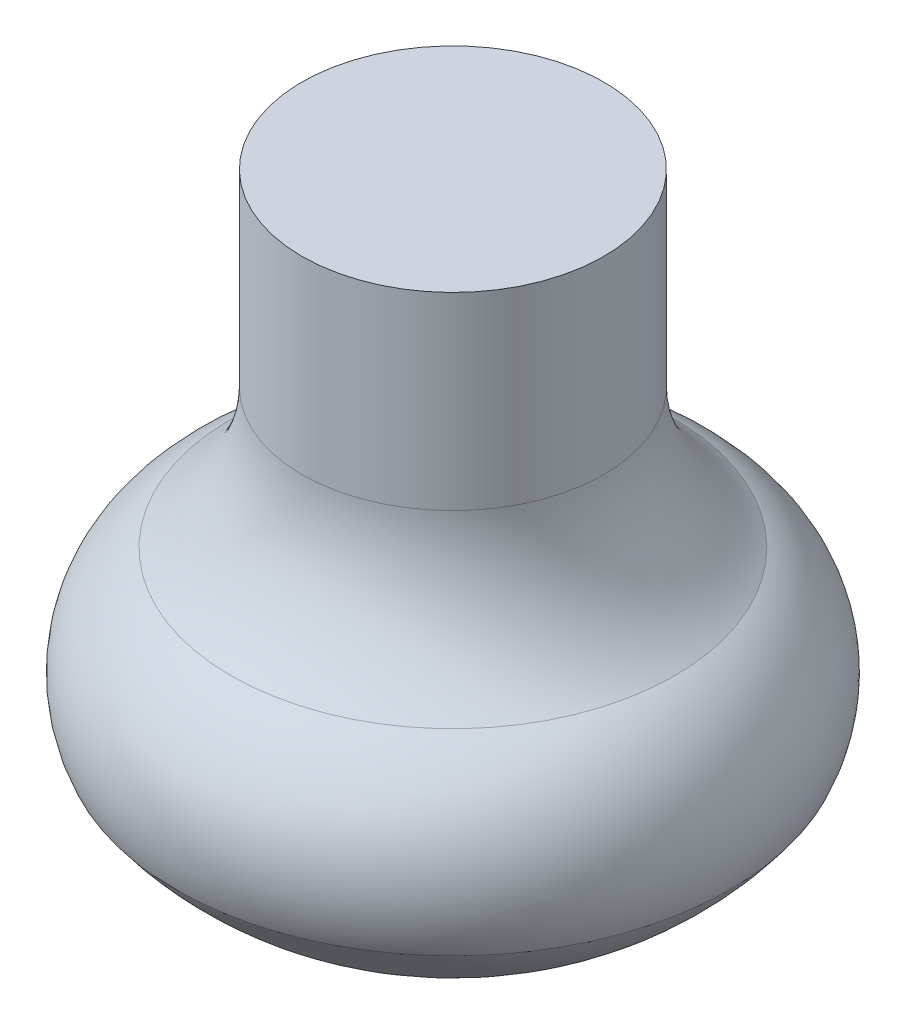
from build123d import *


with BuildPart() as part:
    # Sketch1 → Revolve1 (revolve)
    with BuildSketch(Plane.XY, mode=Mode.PRIVATE) as revolve1_sk:
        with BuildLine():
            Line((15, 41.227139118), (15, 60))
            Line((15, 60), (0, 60))
            Line((0, 60), (0, 0))
            ThreePointArc((0, 0), (15.379656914, 2.077742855), (27.5, 11.770428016))
            ThreePointArc((27.5, 11.770428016), (27.900273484, 20.696689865), (22.054149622, 27.453997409))
            ThreePointArc((22.054149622, 27.453997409), (16.866124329, 33.489884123), (15, 41.227139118))
        make_face()
    revolve(revolve1_sk.sketch.rotate(Axis((0, 60, 0), (0, -1, 0)), 90), axis=Axis((0, 60, 0), (0, -1, 0)))


solid = part.part
